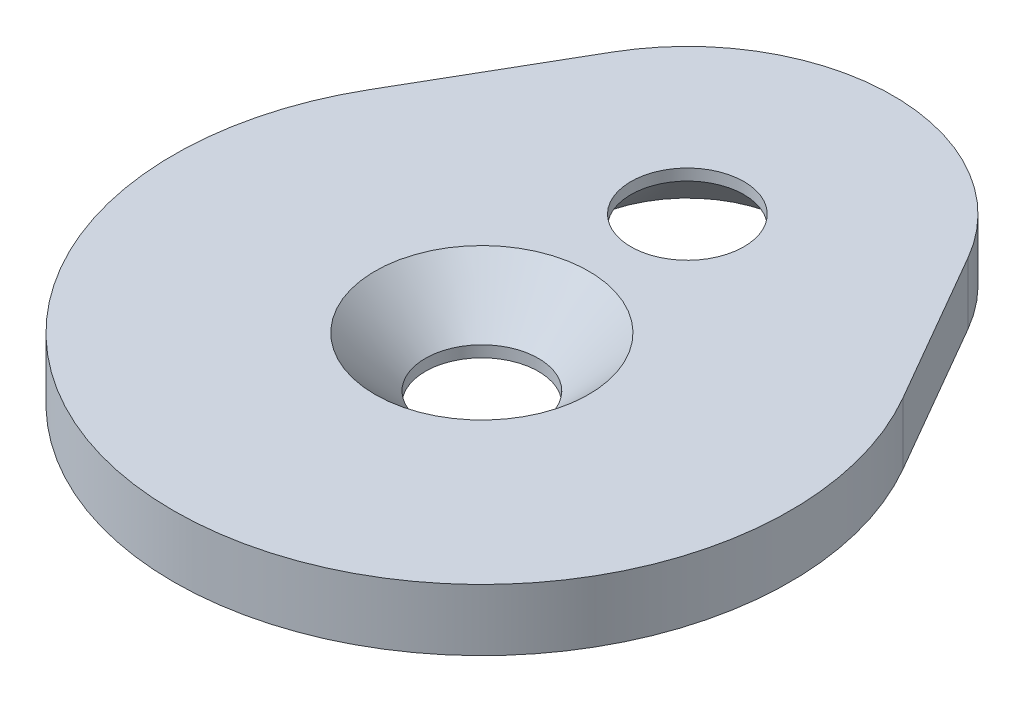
ISO-10303-21;
HEADER;
FILE_DESCRIPTION(('STEP AP214'),'2;1');
FILE_NAME('part.step','',(''),(''),'','','');
FILE_SCHEMA(('AUTOMOTIVE_DESIGN { 1 0 10303 214 1 1 1 1 }'));
ENDSEC;
DATA;
#1=APPLICATION_CONTEXT('core data for automotive mechanical design processes');
#2=APPLICATION_PROTOCOL_DEFINITION('international standard','automotive_design',2000,#1);
#3=PRODUCT_CONTEXT('',#1,'mechanical');
#4=PRODUCT('Part','Part','',(#3));
#5=PRODUCT_RELATED_PRODUCT_CATEGORY('part','',(#4));
#6=PRODUCT_DEFINITION_FORMATION('','',#4);
#7=PRODUCT_DEFINITION_CONTEXT('part definition',#1,'design');
#8=PRODUCT_DEFINITION('design','',#6,#7);
#9=PRODUCT_DEFINITION_SHAPE('','',#8);
#10=(LENGTH_UNIT() NAMED_UNIT(*) SI_UNIT(.MILLI.,.METRE.));
#11=(NAMED_UNIT(*) PLANE_ANGLE_UNIT() SI_UNIT($,.RADIAN.));
#12=(NAMED_UNIT(*) SI_UNIT($,.STERADIAN.) SOLID_ANGLE_UNIT());
#13=UNCERTAINTY_MEASURE_WITH_UNIT(LENGTH_MEASURE(1.E-05),#10,'distance_accuracy_value','');
#14=(GEOMETRIC_REPRESENTATION_CONTEXT(3) GLOBAL_UNCERTAINTY_ASSIGNED_CONTEXT((#13)) GLOBAL_UNIT_ASSIGNED_CONTEXT((#10,
#11,#12)) REPRESENTATION_CONTEXT('',''));
#15=CARTESIAN_POINT('',(0.,0.,0.));
#16=DIRECTION('',(0.,0.,1.));
#17=DIRECTION('',(1.,0.,0.));
#18=AXIS2_PLACEMENT_3D('',#15,#16,#17);
#19=CARTESIAN_POINT('',(0.,0.,-10.));
#20=DIRECTION('',(0.,1.,0.));
#21=DIRECTION('',(0.,0.,1.));
#22=AXIS2_PLACEMENT_3D('',#19,#20,#21);
#23=PLANE('',#22);
#24=CARTESIAN_POINT('',(0.,0.,-10.));
#25=DIRECTION('',(0.,1.,0.));
#26=DIRECTION('',(0.,0.,1.));
#27=AXIS2_PLACEMENT_3D('',#24,#25,#26);
#28=CIRCLE('',#27,10.);
#29=CARTESIAN_POINT('',(8.66025403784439,0.,-15.));
#30=VERTEX_POINT('',#29);
#31=CARTESIAN_POINT('',(-8.66025403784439,0.,-15.));
#32=VERTEX_POINT('',#31);
#33=EDGE_CURVE('E95',#30,#32,#28,.T.);
#34=ORIENTED_EDGE('',*,*,#33,.F.);
#35=DIRECTION('',(-0.5,0.,-0.866025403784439));
#36=VECTOR('',#35,1.);
#37=CARTESIAN_POINT('',(8.66025403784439,0.,-15.));
#38=LINE('',#37,#36);
#39=CARTESIAN_POINT('',(12.9903810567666,0.,-7.49999999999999));
#40=VERTEX_POINT('',#39);
#41=EDGE_CURVE('E71',#40,#30,#38,.T.);
#42=ORIENTED_EDGE('',*,*,#41,.F.);
#43=CARTESIAN_POINT('',(0.,0.,0.));
#44=DIRECTION('',(0.,1.,0.));
#45=DIRECTION('',(0.,0.,1.));
#46=AXIS2_PLACEMENT_3D('',#43,#44,#45);
#47=CIRCLE('',#46,15.);
#48=CARTESIAN_POINT('',(-12.9903810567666,0.,-7.49999999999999));
#49=VERTEX_POINT('',#48);
#50=EDGE_CURVE('E65',#49,#40,#47,.T.);
#51=ORIENTED_EDGE('',*,*,#50,.F.);
#52=DIRECTION('',(-0.5,0.,0.866025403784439));
#53=VECTOR('',#52,1.);
#54=CARTESIAN_POINT('',(-8.66025403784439,0.,-15.));
#55=LINE('',#54,#53);
#56=EDGE_CURVE('E87',#32,#49,#55,.T.);
#57=ORIENTED_EDGE('',*,*,#56,.F.);
#58=EDGE_LOOP('',(#34,#42,#51,#57));
#59=FACE_BOUND('',#58,.T.);
#60=CARTESIAN_POINT('',(0.,0.,0.));
#61=DIRECTION('',(0.,1.,0.));
#62=DIRECTION('',(0.,0.,1.));
#63=AXIS2_PLACEMENT_3D('',#60,#61,#62);
#64=CIRCLE('',#63,2.75);
#65=CARTESIAN_POINT('',(0.,0.,2.75));
#66=VERTEX_POINT('',#65);
#67=EDGE_CURVE('E98',#66,#66,#64,.T.);
#68=ORIENTED_EDGE('',*,*,#67,.T.);
#69=EDGE_LOOP('',(#68));
#70=FACE_BOUND('',#69,.T.);
#71=CARTESIAN_POINT('',(0.,0.,-10.));
#72=DIRECTION('',(0.,-1.,0.));
#73=DIRECTION('',(0.,0.,-1.));
#74=AXIS2_PLACEMENT_3D('',#71,#72,#73);
#75=CIRCLE('',#74,5.2);
#76=CARTESIAN_POINT('',(0.,0.,-15.2));
#77=VERTEX_POINT('',#76);
#78=EDGE_CURVE('E123',#77,#77,#75,.T.);
#79=ORIENTED_EDGE('',*,*,#78,.F.);
#80=EDGE_LOOP('',(#79));
#81=FACE_BOUND('',#80,.T.);
#82=ADVANCED_FACE('F31',(#59,#70,#81),#23,.F.);
#83=CARTESIAN_POINT('',(0.,3.,-10.));
#84=DIRECTION('',(0.,1.,0.));
#85=DIRECTION('',(0.,0.,1.));
#86=AXIS2_PLACEMENT_3D('',#83,#84,#85);
#87=PLANE('',#86);
#88=CARTESIAN_POINT('',(0.,3.,-10.));
#89=DIRECTION('',(0.,-1.,0.));
#90=DIRECTION('',(0.,0.,-1.));
#91=AXIS2_PLACEMENT_3D('',#88,#89,#90);
#92=CIRCLE('',#91,2.75);
#93=CARTESIAN_POINT('',(0.,3.,-12.75));
#94=VERTEX_POINT('',#93);
#95=EDGE_CURVE('E117',#94,#94,#92,.T.);
#96=ORIENTED_EDGE('',*,*,#95,.T.);
#97=EDGE_LOOP('',(#96));
#98=FACE_BOUND('',#97,.T.);
#99=CARTESIAN_POINT('',(0.,3.,0.));
#100=DIRECTION('',(0.,1.,0.));
#101=DIRECTION('',(0.,0.,1.));
#102=AXIS2_PLACEMENT_3D('',#99,#100,#101);
#103=CIRCLE('',#102,5.2);
#104=CARTESIAN_POINT('',(0.,3.,5.2));
#105=VERTEX_POINT('',#104);
#106=EDGE_CURVE('E114',#105,#105,#103,.T.);
#107=ORIENTED_EDGE('',*,*,#106,.F.);
#108=EDGE_LOOP('',(#107));
#109=FACE_BOUND('',#108,.T.);
#110=CARTESIAN_POINT('',(0.,3.,-10.));
#111=DIRECTION('',(0.,1.,0.));
#112=DIRECTION('',(0.,0.,1.));
#113=AXIS2_PLACEMENT_3D('',#110,#111,#112);
#114=CIRCLE('',#113,10.);
#115=CARTESIAN_POINT('',(8.66025403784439,3.,-15.));
#116=VERTEX_POINT('',#115);
#117=CARTESIAN_POINT('',(-8.66025403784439,3.,-15.));
#118=VERTEX_POINT('',#117);
#119=EDGE_CURVE('E83',#116,#118,#114,.T.);
#120=ORIENTED_EDGE('',*,*,#119,.T.);
#121=DIRECTION('',(-0.5,0.,0.866025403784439));
#122=VECTOR('',#121,1.);
#123=CARTESIAN_POINT('',(-8.66025403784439,3.,-15.));
#124=LINE('',#123,#122);
#125=CARTESIAN_POINT('',(-12.9903810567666,3.,-7.49999999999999));
#126=VERTEX_POINT('',#125);
#127=EDGE_CURVE('E78',#118,#126,#124,.T.);
#128=ORIENTED_EDGE('',*,*,#127,.T.);
#129=CARTESIAN_POINT('',(0.,3.,0.));
#130=DIRECTION('',(0.,1.,0.));
#131=DIRECTION('',(0.,0.,1.));
#132=AXIS2_PLACEMENT_3D('',#129,#130,#131);
#133=CIRCLE('',#132,15.);
#134=CARTESIAN_POINT('',(12.9903810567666,3.,-7.49999999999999));
#135=VERTEX_POINT('',#134);
#136=EDGE_CURVE('E81',#126,#135,#133,.T.);
#137=ORIENTED_EDGE('',*,*,#136,.T.);
#138=DIRECTION('',(-0.5,0.,-0.866025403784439));
#139=VECTOR('',#138,1.);
#140=CARTESIAN_POINT('',(8.66025403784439,3.,-15.));
#141=LINE('',#140,#139);
#142=EDGE_CURVE('E48',#135,#116,#141,.T.);
#143=ORIENTED_EDGE('',*,*,#142,.T.);
#144=EDGE_LOOP('',(#120,#128,#137,#143));
#145=FACE_BOUND('',#144,.T.);
#146=ADVANCED_FACE('F79',(#98,#109,#145),#87,.T.);
#147=CARTESIAN_POINT('',(0.,3.,-10.));
#148=DIRECTION('',(0.,-1.,0.));
#149=DIRECTION('',(0.,0.,-1.));
#150=AXIS2_PLACEMENT_3D('',#147,#148,#149);
#151=CYLINDRICAL_SURFACE('',#150,10.);
#152=ORIENTED_EDGE('',*,*,#33,.T.);
#153=DIRECTION('',(0.,-1.,0.));
#154=VECTOR('',#153,1.);
#155=CARTESIAN_POINT('',(-8.66025403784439,3.,-15.));
#156=LINE('',#155,#154);
#157=EDGE_CURVE('E11',#118,#32,#156,.T.);
#158=ORIENTED_EDGE('',*,*,#157,.F.);
#159=ORIENTED_EDGE('',*,*,#119,.F.);
#160=DIRECTION('',(0.,-1.,0.));
#161=VECTOR('',#160,1.);
#162=CARTESIAN_POINT('',(8.66025403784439,3.,-15.));
#163=LINE('',#162,#161);
#164=EDGE_CURVE('E91',#116,#30,#163,.T.);
#165=ORIENTED_EDGE('',*,*,#164,.T.);
#166=EDGE_LOOP('',(#152,#158,#159,#165));
#167=FACE_BOUND('',#166,.T.);
#168=ADVANCED_FACE('F33',(#167),#151,.T.);
#169=CARTESIAN_POINT('',(-8.66025403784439,3.,-15.));
#170=DIRECTION('',(0.866025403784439,0.,0.5));
#171=DIRECTION('',(0.5,0.,-0.866025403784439));
#172=AXIS2_PLACEMENT_3D('',#169,#170,#171);
#173=PLANE('',#172);
#174=ORIENTED_EDGE('',*,*,#56,.T.);
#175=DIRECTION('',(0.,-1.,0.));
#176=VECTOR('',#175,1.);
#177=CARTESIAN_POINT('',(-12.9903810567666,3.,-7.49999999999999));
#178=LINE('',#177,#176);
#179=EDGE_CURVE('E40',#126,#49,#178,.T.);
#180=ORIENTED_EDGE('',*,*,#179,.F.);
#181=ORIENTED_EDGE('',*,*,#127,.F.);
#182=ORIENTED_EDGE('',*,*,#157,.T.);
#183=EDGE_LOOP('',(#174,#180,#181,#182));
#184=FACE_BOUND('',#183,.T.);
#185=ADVANCED_FACE('F86',(#184),#173,.F.);
#186=CARTESIAN_POINT('',(0.,3.,0.));
#187=DIRECTION('',(0.,-1.,0.));
#188=DIRECTION('',(0.,0.,-1.));
#189=AXIS2_PLACEMENT_3D('',#186,#187,#188);
#190=CYLINDRICAL_SURFACE('',#189,15.);
#191=ORIENTED_EDGE('',*,*,#50,.T.);
#192=DIRECTION('',(0.,-1.,0.));
#193=VECTOR('',#192,1.);
#194=CARTESIAN_POINT('',(12.9903810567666,3.,-7.49999999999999));
#195=LINE('',#194,#193);
#196=EDGE_CURVE('E88',#135,#40,#195,.T.);
#197=ORIENTED_EDGE('',*,*,#196,.F.);
#198=ORIENTED_EDGE('',*,*,#136,.F.);
#199=ORIENTED_EDGE('',*,*,#179,.T.);
#200=EDGE_LOOP('',(#191,#197,#198,#199));
#201=FACE_BOUND('',#200,.T.);
#202=ADVANCED_FACE('F89',(#201),#190,.T.);
#203=CARTESIAN_POINT('',(8.66025403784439,3.,-15.));
#204=DIRECTION('',(-0.866025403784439,0.,0.5));
#205=DIRECTION('',(0.5,0.,0.866025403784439));
#206=AXIS2_PLACEMENT_3D('',#203,#204,#205);
#207=PLANE('',#206);
#208=ORIENTED_EDGE('',*,*,#41,.T.);
#209=ORIENTED_EDGE('',*,*,#164,.F.);
#210=ORIENTED_EDGE('',*,*,#142,.F.);
#211=ORIENTED_EDGE('',*,*,#196,.T.);
#212=EDGE_LOOP('',(#208,#209,#210,#211));
#213=FACE_BOUND('',#212,.T.);
#214=ADVANCED_FACE('F103',(#213),#207,.F.);
#215=CARTESIAN_POINT('',(0.,3.,0.));
#216=DIRECTION('',(0.,1.,0.));
#217=DIRECTION('',(0.,0.,1.));
#218=AXIS2_PLACEMENT_3D('',#215,#216,#217);
#219=CYLINDRICAL_SURFACE('',#218,2.75);
#220=ORIENTED_EDGE('',*,*,#67,.F.);
#221=EDGE_LOOP('',(#220));
#222=FACE_BOUND('',#221,.T.);
#223=CARTESIAN_POINT('',(0.,0.550000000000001,0.));
#224=DIRECTION('',(0.,1.,0.));
#225=DIRECTION('',(0.,0.,1.));
#226=AXIS2_PLACEMENT_3D('',#223,#224,#225);
#227=CIRCLE('',#226,2.75);
#228=CARTESIAN_POINT('',(0.,0.550000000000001,2.75));
#229=VERTEX_POINT('',#228);
#230=EDGE_CURVE('E111',#229,#229,#227,.T.);
#231=ORIENTED_EDGE('',*,*,#230,.T.);
#232=EDGE_LOOP('',(#231));
#233=FACE_BOUND('',#232,.T.);
#234=ADVANCED_FACE('F140',(#222,#233),#219,.F.);
#235=CARTESIAN_POINT('',(0.,3.,0.));
#236=DIRECTION('',(0.,1.,0.));
#237=DIRECTION('',(0.,0.,1.));
#238=AXIS2_PLACEMENT_3D('',#235,#236,#237);
#239=CONICAL_SURFACE('',#238,5.2,0.785398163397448);
#240=ORIENTED_EDGE('',*,*,#230,.F.);
#241=EDGE_LOOP('',(#240));
#242=FACE_BOUND('',#241,.T.);
#243=ORIENTED_EDGE('',*,*,#106,.T.);
#244=EDGE_LOOP('',(#243));
#245=FACE_BOUND('',#244,.T.);
#246=ADVANCED_FACE('F165',(#242,#245),#239,.F.);
#247=CARTESIAN_POINT('',(0.,0.,-10.));
#248=DIRECTION('',(0.,-1.,0.));
#249=DIRECTION('',(0.,0.,-1.));
#250=AXIS2_PLACEMENT_3D('',#247,#248,#249);
#251=CYLINDRICAL_SURFACE('',#250,2.74999999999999);
#252=ORIENTED_EDGE('',*,*,#95,.F.);
#253=EDGE_LOOP('',(#252));
#254=FACE_BOUND('',#253,.T.);
#255=CARTESIAN_POINT('',(0.,2.45000000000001,-10.));
#256=DIRECTION('',(0.,-1.,0.));
#257=DIRECTION('',(0.,0.,-1.));
#258=AXIS2_PLACEMENT_3D('',#255,#256,#257);
#259=CIRCLE('',#258,2.74999999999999);
#260=CARTESIAN_POINT('',(0.,2.45000000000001,-12.75));
#261=VERTEX_POINT('',#260);
#262=EDGE_CURVE('E120',#261,#261,#259,.T.);
#263=ORIENTED_EDGE('',*,*,#262,.T.);
#264=EDGE_LOOP('',(#263));
#265=FACE_BOUND('',#264,.T.);
#266=ADVANCED_FACE('F160',(#254,#265),#251,.F.);
#267=CARTESIAN_POINT('',(0.,0.,-10.));
#268=DIRECTION('',(0.,-1.,0.));
#269=DIRECTION('',(0.,0.,-1.));
#270=AXIS2_PLACEMENT_3D('',#267,#268,#269);
#271=CONICAL_SURFACE('',#270,5.2,0.785398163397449);
#272=ORIENTED_EDGE('',*,*,#262,.F.);
#273=EDGE_LOOP('',(#272));
#274=FACE_BOUND('',#273,.T.);
#275=ORIENTED_EDGE('',*,*,#78,.T.);
#276=EDGE_LOOP('',(#275));
#277=FACE_BOUND('',#276,.T.);
#278=ADVANCED_FACE('F127',(#274,#277),#271,.F.);
#279=CLOSED_SHELL('',(#82,#146,#168,#185,#202,#214,#234,#246,#266,#278));
#280=MANIFOLD_SOLID_BREP('B2',#279);
#281=ADVANCED_BREP_SHAPE_REPRESENTATION('',(#18,#280),#14);
#282=SHAPE_DEFINITION_REPRESENTATION(#9,#281);
ENDSEC;
END-ISO-10303-21;
